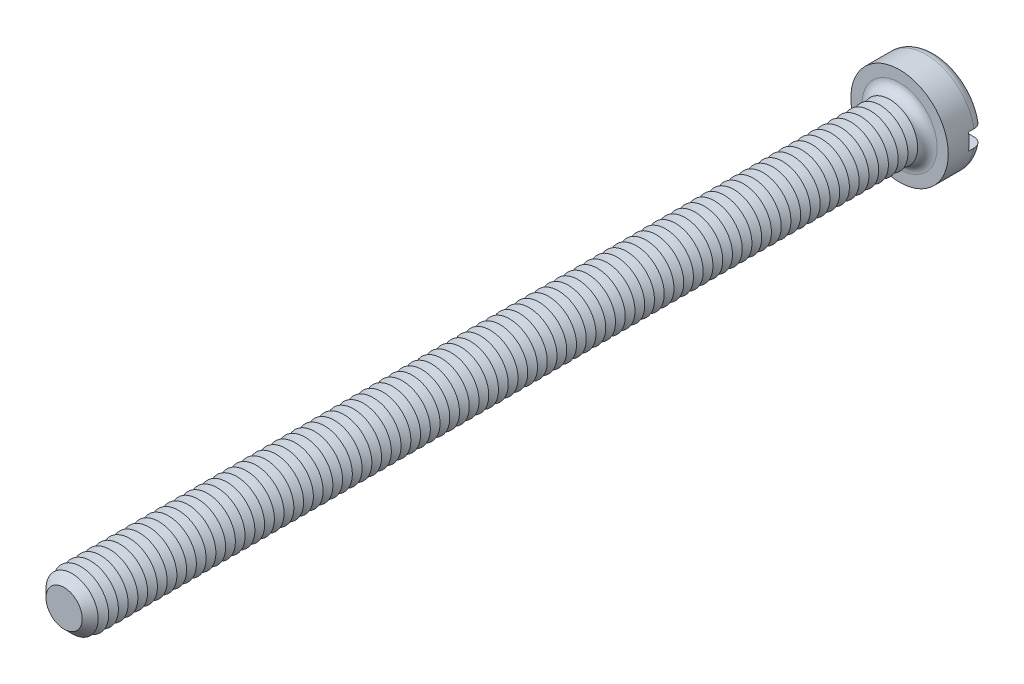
from build123d import *

# Parameters (mm, degrees)
SKETCH3_R           = 3.5
BOSS_EXTRUDE2_DEPTH = 2.6
SKETCH4_R           = 2
BOSS_EXTRUDE3_DEPTH = 60
FILLET1_R           = 0.7
CHAMFER1_SIZE       = 0.7
LPATTERN1_COUNT     = 84
LPATTERN1_PITCH     = 0.7
SKETCH8_W           = 7
SKETCH8_H           = 1.2
CUT_EXTRUDE1_DEPTH  = 1.1


with BuildPart() as part:
    # Sketch3 → Boss-Extrude2 (new body)
    with BuildSketch(Plane.XY):
        Circle(SKETCH3_R)
    extrude(amount=-BOSS_EXTRUDE2_DEPTH)

    # Sketch4 → Boss-Extrude3 (add)
    with BuildSketch(Plane.XY):
        Circle(SKETCH4_R)
    extrude(amount=BOSS_EXTRUDE3_DEPTH)

    # Fillet1
    fillet1_edges = [part.edges().sort_by_distance(p)[0] for p in [
        (-3.5, 0, -2.6),
        (-2, 0, 0),
    ]]
    fillet(fillet1_edges, radius=FILLET1_R)

    # Chamfer1
    chamfer1_edges = [part.edges().sort_by_distance(p)[0] for p in [
        (-2, 0, 60),
    ]]
    chamfer(chamfer1_edges, length=CHAMFER1_SIZE)

    # Sketch6 → Cut-Revolve1 (revolve, cut)
    with BuildSketch(Plane(origin=(0, 0, 0), x_dir=(0, 0, -1), z_dir=(1, 0, 0)), mode=Mode.PRIVATE) as cut_revolve1_sk:
        Polygon((-0.7, 2), (-1.05, 1.393782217), (-1.4, 2), align=None)
    cut_revolve1 = revolve(cut_revolve1_sk.sketch.rotate(Axis((0, 0, -1.694361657), (0, 0, 1)), 90), axis=Axis((0, 0, -1.694361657), (0, 0, 1)), mode=Mode.SUBTRACT)

    # LPattern1: Cut-Revolve1 ×84
    with Locations(*[(0, 0, i * LPATTERN1_PITCH) for i in range(1, LPATTERN1_COUNT)]):
        add(cut_revolve1, mode=Mode.SUBTRACT)

    # Sketch8 → Cut-Extrude1 (cut)
    with BuildSketch(Plane(origin=(0, 0, -2.6), x_dir=(-1, 0, 0), z_dir=(0, 0, -1))):
        Rectangle(SKETCH8_W, SKETCH8_H)
    extrude(amount=-CUT_EXTRUDE1_DEPTH, mode=Mode.SUBTRACT)


solid = part.part
